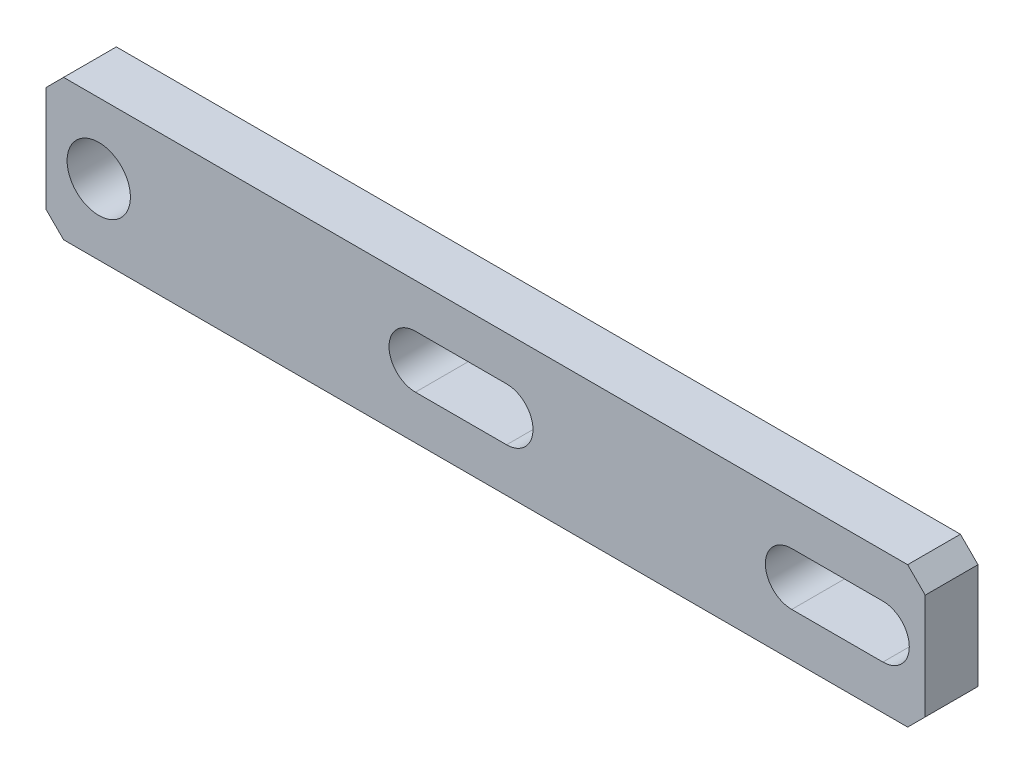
from build123d import *

# Parameters (mm, degrees)
AUFSATZ_LINEAR_AUSTRAGEN1_DEPTH  = 15
SCHNITT_LINEAR_AUSTRAGEN1_DEPTH  = 254.623737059
F_18_0_18_DURCHMESSER_BOHRUNG1_D = 18


with BuildPart() as part:
    # Skizze1 → Aufsatz-Linear austragen1 (new body)
    with BuildSketch(Plane.XY):
        Polygon((0, 5), (0, 35), (5, 40), (245, 40), (250, 35), (250, 5), (245, 0), (5, 0), align=None)
        with BuildLine():
            Line((237.960845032, 12.5), (212.039154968, 12.5))
            ThreePointArc((212.039154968, 12.5), (204.539154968, 20), (212.039154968, 27.5))
            Line((212.039154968, 27.5), (237.960845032, 27.5))
            ThreePointArc((237.960845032, 27.5), (245.460845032, 20), (237.960845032, 12.5))
        make_face(mode=Mode.SUBTRACT)
    extrude(amount=AUFSATZ_LINEAR_AUSTRAGEN1_DEPTH)

    # Skizze9 → Schnitt-Linear austragen1 (cut, through all)
    with BuildSketch(Plane.XY.offset(15)):
        with BuildLine():
            Line((130.96, 12.5), (105.04, 12.5))
            ThreePointArc((105.04, 12.5), (97.54, 20), (105.04, 27.5))
            Line((105.04, 27.5), (130.96, 27.5))
            ThreePointArc((130.96, 27.5), (138.46, 20), (130.96, 12.5))
        make_face()
    extrude(amount=-SCHNITT_LINEAR_AUSTRAGEN1_DEPTH, mode=Mode.SUBTRACT)

    # 18.0 _18_ Durchmesser Bohrung1 (through all)
    with Locations(Plane.XY.offset(15)):
        with Locations((15, 20)):
            Hole(F_18_0_18_DURCHMESSER_BOHRUNG1_D / 2)


solid = part.part
